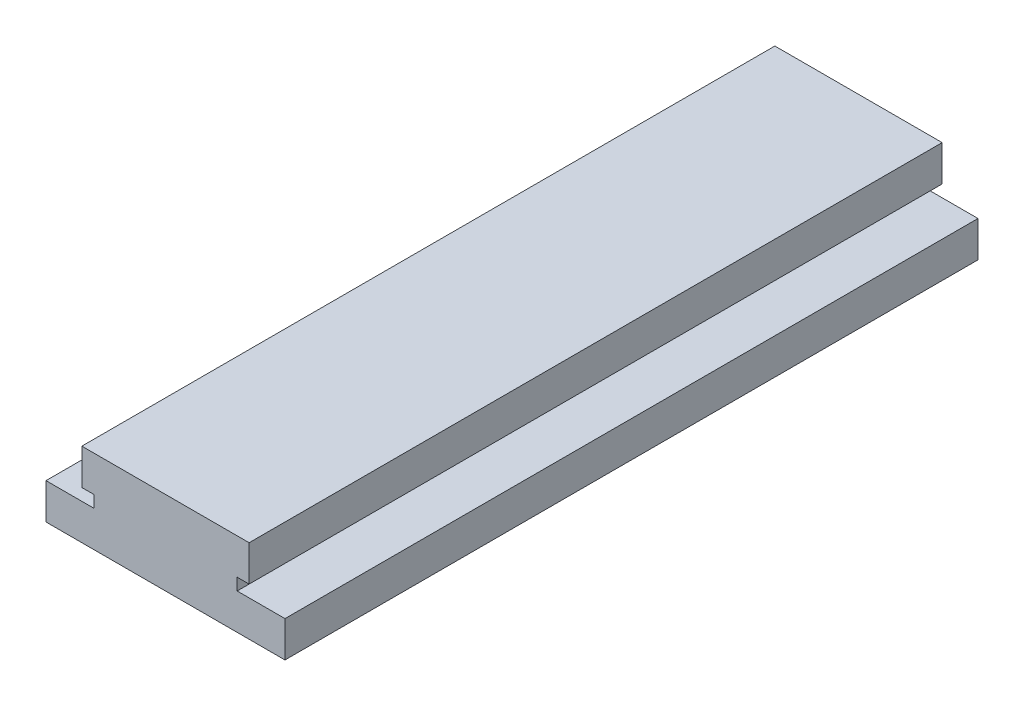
ISO-10303-21;
HEADER;
FILE_DESCRIPTION(('STEP AP214'),'2;1');
FILE_NAME('part.step','',(''),(''),'','','');
FILE_SCHEMA(('AUTOMOTIVE_DESIGN { 1 0 10303 214 1 1 1 1 }'));
ENDSEC;
DATA;
#1=APPLICATION_CONTEXT('core data for automotive mechanical design processes');
#2=APPLICATION_PROTOCOL_DEFINITION('international standard','automotive_design',2000,#1);
#3=PRODUCT_CONTEXT('',#1,'mechanical');
#4=PRODUCT('Part','Part','',(#3));
#5=PRODUCT_RELATED_PRODUCT_CATEGORY('part','',(#4));
#6=PRODUCT_DEFINITION_FORMATION('','',#4);
#7=PRODUCT_DEFINITION_CONTEXT('part definition',#1,'design');
#8=PRODUCT_DEFINITION('design','',#6,#7);
#9=PRODUCT_DEFINITION_SHAPE('','',#8);
#10=(LENGTH_UNIT() NAMED_UNIT(*) SI_UNIT(.MILLI.,.METRE.));
#11=(NAMED_UNIT(*) PLANE_ANGLE_UNIT() SI_UNIT($,.RADIAN.));
#12=(NAMED_UNIT(*) SI_UNIT($,.STERADIAN.) SOLID_ANGLE_UNIT());
#13=UNCERTAINTY_MEASURE_WITH_UNIT(LENGTH_MEASURE(1.E-05),#10,'distance_accuracy_value','');
#14=(GEOMETRIC_REPRESENTATION_CONTEXT(3) GLOBAL_UNCERTAINTY_ASSIGNED_CONTEXT((#13)) GLOBAL_UNIT_ASSIGNED_CONTEXT((#10,
#11,#12)) REPRESENTATION_CONTEXT('',''));
#15=CARTESIAN_POINT('',(0.,0.,0.));
#16=DIRECTION('',(0.,0.,1.));
#17=DIRECTION('',(1.,0.,0.));
#18=AXIS2_PLACEMENT_3D('',#15,#16,#17);
#19=CARTESIAN_POINT('',(-10.,3.,29.));
#20=DIRECTION('',(1.,0.,0.));
#21=DIRECTION('',(0.,0.,-1.));
#22=AXIS2_PLACEMENT_3D('',#19,#20,#21);
#23=PLANE('',#22);
#24=DIRECTION('',(0.,0.,-1.));
#25=VECTOR('',#24,1.);
#26=CARTESIAN_POINT('',(-10.,3.,29.));
#27=LINE('',#26,#25);
#28=CARTESIAN_POINT('',(-10.,3.,29.));
#29=VERTEX_POINT('',#28);
#30=CARTESIAN_POINT('',(-10.,3.,-29.));
#31=VERTEX_POINT('',#30);
#32=EDGE_CURVE('E136',#29,#31,#27,.T.);
#33=ORIENTED_EDGE('',*,*,#32,.T.);
#34=DIRECTION('',(0.,-1.,0.));
#35=VECTOR('',#34,1.);
#36=CARTESIAN_POINT('',(-10.,3.,-29.));
#37=LINE('',#36,#35);
#38=CARTESIAN_POINT('',(-10.,0.,-29.));
#39=VERTEX_POINT('',#38);
#40=EDGE_CURVE('E130',#31,#39,#37,.T.);
#41=ORIENTED_EDGE('',*,*,#40,.T.);
#42=DIRECTION('',(0.,0.,-1.));
#43=VECTOR('',#42,1.);
#44=CARTESIAN_POINT('',(-10.,0.,29.));
#45=LINE('',#44,#43);
#46=CARTESIAN_POINT('',(-10.,0.,29.));
#47=VERTEX_POINT('',#46);
#48=EDGE_CURVE('E11',#47,#39,#45,.T.);
#49=ORIENTED_EDGE('',*,*,#48,.F.);
#50=DIRECTION('',(0.,-1.,0.));
#51=VECTOR('',#50,1.);
#52=CARTESIAN_POINT('',(-10.,3.,29.));
#53=LINE('',#52,#51);
#54=EDGE_CURVE('E166',#29,#47,#53,.T.);
#55=ORIENTED_EDGE('',*,*,#54,.F.);
#56=EDGE_LOOP('',(#33,#41,#49,#55));
#57=FACE_BOUND('',#56,.T.);
#58=ADVANCED_FACE('F30',(#57),#23,.F.);
#59=CARTESIAN_POINT('',(-10.,0.,29.));
#60=DIRECTION('',(0.,1.,0.));
#61=DIRECTION('',(0.,0.,1.));
#62=AXIS2_PLACEMENT_3D('',#59,#60,#61);
#63=PLANE('',#62);
#64=ORIENTED_EDGE('',*,*,#48,.T.);
#65=DIRECTION('',(1.,0.,0.));
#66=VECTOR('',#65,1.);
#67=CARTESIAN_POINT('',(-10.,0.,-29.));
#68=LINE('',#67,#66);
#69=CARTESIAN_POINT('',(10.,0.,-29.));
#70=VERTEX_POINT('',#69);
#71=EDGE_CURVE('E120',#39,#70,#68,.T.);
#72=ORIENTED_EDGE('',*,*,#71,.T.);
#73=DIRECTION('',(0.,0.,-1.));
#74=VECTOR('',#73,1.);
#75=CARTESIAN_POINT('',(10.,0.,29.));
#76=LINE('',#75,#74);
#77=CARTESIAN_POINT('',(10.,0.,29.));
#78=VERTEX_POINT('',#77);
#79=EDGE_CURVE('E37',#78,#70,#76,.T.);
#80=ORIENTED_EDGE('',*,*,#79,.F.);
#81=DIRECTION('',(1.,0.,0.));
#82=VECTOR('',#81,1.);
#83=CARTESIAN_POINT('',(-10.,0.,29.));
#84=LINE('',#83,#82);
#85=EDGE_CURVE('E121',#47,#78,#84,.T.);
#86=ORIENTED_EDGE('',*,*,#85,.F.);
#87=EDGE_LOOP('',(#64,#72,#80,#86));
#88=FACE_BOUND('',#87,.T.);
#89=ADVANCED_FACE('F118',(#88),#63,.F.);
#90=CARTESIAN_POINT('',(10.,0.,29.));
#91=DIRECTION('',(-1.,0.,0.));
#92=DIRECTION('',(0.,0.,1.));
#93=AXIS2_PLACEMENT_3D('',#90,#91,#92);
#94=PLANE('',#93);
#95=ORIENTED_EDGE('',*,*,#79,.T.);
#96=DIRECTION('',(0.,1.,0.));
#97=VECTOR('',#96,1.);
#98=CARTESIAN_POINT('',(10.,0.,-29.));
#99=LINE('',#98,#97);
#100=CARTESIAN_POINT('',(10.,3.,-29.));
#101=VERTEX_POINT('',#100);
#102=EDGE_CURVE('E134',#70,#101,#99,.T.);
#103=ORIENTED_EDGE('',*,*,#102,.T.);
#104=DIRECTION('',(0.,0.,-1.));
#105=VECTOR('',#104,1.);
#106=CARTESIAN_POINT('',(10.,3.,29.));
#107=LINE('',#106,#105);
#108=CARTESIAN_POINT('',(10.,3.,29.));
#109=VERTEX_POINT('',#108);
#110=EDGE_CURVE('E204',#109,#101,#107,.T.);
#111=ORIENTED_EDGE('',*,*,#110,.F.);
#112=DIRECTION('',(0.,1.,0.));
#113=VECTOR('',#112,1.);
#114=CARTESIAN_POINT('',(10.,0.,29.));
#115=LINE('',#114,#113);
#116=EDGE_CURVE('E169',#78,#109,#115,.T.);
#117=ORIENTED_EDGE('',*,*,#116,.F.);
#118=EDGE_LOOP('',(#95,#103,#111,#117));
#119=FACE_BOUND('',#118,.T.);
#120=ADVANCED_FACE('F207',(#119),#94,.F.);
#121=CARTESIAN_POINT('',(10.,3.,29.));
#122=DIRECTION('',(0.,-1.,0.));
#123=DIRECTION('',(1.,0.,0.));
#124=AXIS2_PLACEMENT_3D('',#121,#122,#123);
#125=PLANE('',#124);
#126=ORIENTED_EDGE('',*,*,#110,.T.);
#127=DIRECTION('',(-1.,0.,0.));
#128=VECTOR('',#127,1.);
#129=CARTESIAN_POINT('',(10.,3.,-29.));
#130=LINE('',#129,#128);
#131=CARTESIAN_POINT('',(6.,3.,-29.));
#132=VERTEX_POINT('',#131);
#133=EDGE_CURVE('E140',#101,#132,#130,.T.);
#134=ORIENTED_EDGE('',*,*,#133,.T.);
#135=DIRECTION('',(0.,0.,-1.));
#136=VECTOR('',#135,1.);
#137=CARTESIAN_POINT('',(6.,3.,29.));
#138=LINE('',#137,#136);
#139=CARTESIAN_POINT('',(6.,3.,29.));
#140=VERTEX_POINT('',#139);
#141=EDGE_CURVE('E202',#140,#132,#138,.T.);
#142=ORIENTED_EDGE('',*,*,#141,.F.);
#143=DIRECTION('',(-1.,0.,0.));
#144=VECTOR('',#143,1.);
#145=CARTESIAN_POINT('',(10.,3.,29.));
#146=LINE('',#145,#144);
#147=EDGE_CURVE('E171',#109,#140,#146,.T.);
#148=ORIENTED_EDGE('',*,*,#147,.F.);
#149=EDGE_LOOP('',(#126,#134,#142,#148));
#150=FACE_BOUND('',#149,.T.);
#151=ADVANCED_FACE('F215',(#150),#125,.F.);
#152=CARTESIAN_POINT('',(6.,4.,29.));
#153=DIRECTION('',(-1.,0.,0.));
#154=DIRECTION('',(0.,0.,1.));
#155=AXIS2_PLACEMENT_3D('',#152,#153,#154);
#156=PLANE('',#155);
#157=ORIENTED_EDGE('',*,*,#141,.T.);
#158=DIRECTION('',(0.,1.,0.));
#159=VECTOR('',#158,1.);
#160=CARTESIAN_POINT('',(6.,4.,-29.));
#161=LINE('',#160,#159);
#162=CARTESIAN_POINT('',(6.,4.,-29.));
#163=VERTEX_POINT('',#162);
#164=EDGE_CURVE('E143',#132,#163,#161,.T.);
#165=ORIENTED_EDGE('',*,*,#164,.T.);
#166=DIRECTION('',(0.,0.,-1.));
#167=VECTOR('',#166,1.);
#168=CARTESIAN_POINT('',(6.,4.,29.));
#169=LINE('',#168,#167);
#170=CARTESIAN_POINT('',(6.,4.,29.));
#171=VERTEX_POINT('',#170);
#172=EDGE_CURVE('E200',#171,#163,#169,.T.);
#173=ORIENTED_EDGE('',*,*,#172,.F.);
#174=DIRECTION('',(0.,1.,0.));
#175=VECTOR('',#174,1.);
#176=CARTESIAN_POINT('',(6.,4.,29.));
#177=LINE('',#176,#175);
#178=EDGE_CURVE('E173',#140,#171,#177,.T.);
#179=ORIENTED_EDGE('',*,*,#178,.F.);
#180=EDGE_LOOP('',(#157,#165,#173,#179));
#181=FACE_BOUND('',#180,.T.);
#182=ADVANCED_FACE('F218',(#181),#156,.F.);
#183=CARTESIAN_POINT('',(7.,4.,29.));
#184=DIRECTION('',(0.,1.,0.));
#185=DIRECTION('',(0.,0.,1.));
#186=AXIS2_PLACEMENT_3D('',#183,#184,#185);
#187=PLANE('',#186);
#188=ORIENTED_EDGE('',*,*,#172,.T.);
#189=DIRECTION('',(1.,0.,0.));
#190=VECTOR('',#189,1.);
#191=CARTESIAN_POINT('',(7.,4.,-29.));
#192=LINE('',#191,#190);
#193=CARTESIAN_POINT('',(7.,4.,-29.));
#194=VERTEX_POINT('',#193);
#195=EDGE_CURVE('E146',#163,#194,#192,.T.);
#196=ORIENTED_EDGE('',*,*,#195,.T.);
#197=DIRECTION('',(0.,0.,-1.));
#198=VECTOR('',#197,1.);
#199=CARTESIAN_POINT('',(7.,4.,29.));
#200=LINE('',#199,#198);
#201=CARTESIAN_POINT('',(7.,4.,29.));
#202=VERTEX_POINT('',#201);
#203=EDGE_CURVE('E198',#202,#194,#200,.T.);
#204=ORIENTED_EDGE('',*,*,#203,.F.);
#205=DIRECTION('',(1.,0.,0.));
#206=VECTOR('',#205,1.);
#207=CARTESIAN_POINT('',(7.,4.,29.));
#208=LINE('',#207,#206);
#209=EDGE_CURVE('E175',#171,#202,#208,.T.);
#210=ORIENTED_EDGE('',*,*,#209,.F.);
#211=EDGE_LOOP('',(#188,#196,#204,#210));
#212=FACE_BOUND('',#211,.T.);
#213=ADVANCED_FACE('F223',(#212),#187,.F.);
#214=CARTESIAN_POINT('',(7.,7.,29.));
#215=DIRECTION('',(-1.,0.,0.));
#216=DIRECTION('',(0.,0.,1.));
#217=AXIS2_PLACEMENT_3D('',#214,#215,#216);
#218=PLANE('',#217);
#219=ORIENTED_EDGE('',*,*,#203,.T.);
#220=DIRECTION('',(0.,1.,0.));
#221=VECTOR('',#220,1.);
#222=CARTESIAN_POINT('',(7.,7.,-29.));
#223=LINE('',#222,#221);
#224=CARTESIAN_POINT('',(7.,7.,-29.));
#225=VERTEX_POINT('',#224);
#226=EDGE_CURVE('E149',#194,#225,#223,.T.);
#227=ORIENTED_EDGE('',*,*,#226,.T.);
#228=DIRECTION('',(0.,0.,-1.));
#229=VECTOR('',#228,1.);
#230=CARTESIAN_POINT('',(7.,7.,29.));
#231=LINE('',#230,#229);
#232=CARTESIAN_POINT('',(7.,7.,29.));
#233=VERTEX_POINT('',#232);
#234=EDGE_CURVE('E196',#233,#225,#231,.T.);
#235=ORIENTED_EDGE('',*,*,#234,.F.);
#236=DIRECTION('',(0.,1.,0.));
#237=VECTOR('',#236,1.);
#238=CARTESIAN_POINT('',(7.,7.,29.));
#239=LINE('',#238,#237);
#240=EDGE_CURVE('E177',#202,#233,#239,.T.);
#241=ORIENTED_EDGE('',*,*,#240,.F.);
#242=EDGE_LOOP('',(#219,#227,#235,#241));
#243=FACE_BOUND('',#242,.T.);
#244=ADVANCED_FACE('F229',(#243),#218,.F.);
#245=CARTESIAN_POINT('',(-7.,7.,29.));
#246=DIRECTION('',(0.,-1.,0.));
#247=DIRECTION('',(0.,0.,-1.));
#248=AXIS2_PLACEMENT_3D('',#245,#246,#247);
#249=PLANE('',#248);
#250=ORIENTED_EDGE('',*,*,#234,.T.);
#251=DIRECTION('',(-1.,0.,0.));
#252=VECTOR('',#251,1.);
#253=CARTESIAN_POINT('',(-7.,7.,-29.));
#254=LINE('',#253,#252);
#255=CARTESIAN_POINT('',(-7.,7.,-29.));
#256=VERTEX_POINT('',#255);
#257=EDGE_CURVE('E152',#225,#256,#254,.T.);
#258=ORIENTED_EDGE('',*,*,#257,.T.);
#259=DIRECTION('',(0.,0.,-1.));
#260=VECTOR('',#259,1.);
#261=CARTESIAN_POINT('',(-7.,7.,29.));
#262=LINE('',#261,#260);
#263=CARTESIAN_POINT('',(-7.,7.,29.));
#264=VERTEX_POINT('',#263);
#265=EDGE_CURVE('E194',#264,#256,#262,.T.);
#266=ORIENTED_EDGE('',*,*,#265,.F.);
#267=DIRECTION('',(-1.,0.,0.));
#268=VECTOR('',#267,1.);
#269=CARTESIAN_POINT('',(-7.,7.,29.));
#270=LINE('',#269,#268);
#271=EDGE_CURVE('E179',#233,#264,#270,.T.);
#272=ORIENTED_EDGE('',*,*,#271,.F.);
#273=EDGE_LOOP('',(#250,#258,#266,#272));
#274=FACE_BOUND('',#273,.T.);
#275=ADVANCED_FACE('F233',(#274),#249,.F.);
#276=CARTESIAN_POINT('',(-7.,4.,29.));
#277=DIRECTION('',(1.,0.,0.));
#278=DIRECTION('',(0.,0.,-1.));
#279=AXIS2_PLACEMENT_3D('',#276,#277,#278);
#280=PLANE('',#279);
#281=ORIENTED_EDGE('',*,*,#265,.T.);
#282=DIRECTION('',(0.,-1.,0.));
#283=VECTOR('',#282,1.);
#284=CARTESIAN_POINT('',(-7.,4.,-29.));
#285=LINE('',#284,#283);
#286=CARTESIAN_POINT('',(-7.,4.,-29.));
#287=VERTEX_POINT('',#286);
#288=EDGE_CURVE('E155',#256,#287,#285,.T.);
#289=ORIENTED_EDGE('',*,*,#288,.T.);
#290=DIRECTION('',(0.,0.,-1.));
#291=VECTOR('',#290,1.);
#292=CARTESIAN_POINT('',(-7.,4.,29.));
#293=LINE('',#292,#291);
#294=CARTESIAN_POINT('',(-7.,4.,29.));
#295=VERTEX_POINT('',#294);
#296=EDGE_CURVE('E192',#295,#287,#293,.T.);
#297=ORIENTED_EDGE('',*,*,#296,.F.);
#298=DIRECTION('',(0.,-1.,0.));
#299=VECTOR('',#298,1.);
#300=CARTESIAN_POINT('',(-7.,4.,29.));
#301=LINE('',#300,#299);
#302=EDGE_CURVE('E181',#264,#295,#301,.T.);
#303=ORIENTED_EDGE('',*,*,#302,.F.);
#304=EDGE_LOOP('',(#281,#289,#297,#303));
#305=FACE_BOUND('',#304,.T.);
#306=ADVANCED_FACE('F238',(#305),#280,.F.);
#307=CARTESIAN_POINT('',(-6.,4.,29.));
#308=DIRECTION('',(0.,1.,0.));
#309=DIRECTION('',(0.,0.,1.));
#310=AXIS2_PLACEMENT_3D('',#307,#308,#309);
#311=PLANE('',#310);
#312=ORIENTED_EDGE('',*,*,#296,.T.);
#313=DIRECTION('',(1.,0.,0.));
#314=VECTOR('',#313,1.);
#315=CARTESIAN_POINT('',(-6.,4.,-29.));
#316=LINE('',#315,#314);
#317=CARTESIAN_POINT('',(-6.,4.,-29.));
#318=VERTEX_POINT('',#317);
#319=EDGE_CURVE('E158',#287,#318,#316,.T.);
#320=ORIENTED_EDGE('',*,*,#319,.T.);
#321=DIRECTION('',(0.,0.,-1.));
#322=VECTOR('',#321,1.);
#323=CARTESIAN_POINT('',(-6.,4.,29.));
#324=LINE('',#323,#322);
#325=CARTESIAN_POINT('',(-6.,4.,29.));
#326=VERTEX_POINT('',#325);
#327=EDGE_CURVE('E190',#326,#318,#324,.T.);
#328=ORIENTED_EDGE('',*,*,#327,.F.);
#329=DIRECTION('',(1.,0.,0.));
#330=VECTOR('',#329,1.);
#331=CARTESIAN_POINT('',(-6.,4.,29.));
#332=LINE('',#331,#330);
#333=EDGE_CURVE('E183',#295,#326,#332,.T.);
#334=ORIENTED_EDGE('',*,*,#333,.F.);
#335=EDGE_LOOP('',(#312,#320,#328,#334));
#336=FACE_BOUND('',#335,.T.);
#337=ADVANCED_FACE('F242',(#336),#311,.F.);
#338=CARTESIAN_POINT('',(-6.,3.,29.));
#339=DIRECTION('',(1.,0.,0.));
#340=DIRECTION('',(0.,1.,0.));
#341=AXIS2_PLACEMENT_3D('',#338,#339,#340);
#342=PLANE('',#341);
#343=ORIENTED_EDGE('',*,*,#327,.T.);
#344=DIRECTION('',(0.,-1.,0.));
#345=VECTOR('',#344,1.);
#346=CARTESIAN_POINT('',(-6.,3.,-29.));
#347=LINE('',#346,#345);
#348=CARTESIAN_POINT('',(-6.,3.,-29.));
#349=VERTEX_POINT('',#348);
#350=EDGE_CURVE('E161',#318,#349,#347,.T.);
#351=ORIENTED_EDGE('',*,*,#350,.T.);
#352=DIRECTION('',(0.,0.,-1.));
#353=VECTOR('',#352,1.);
#354=CARTESIAN_POINT('',(-6.,3.,29.));
#355=LINE('',#354,#353);
#356=CARTESIAN_POINT('',(-6.,3.,29.));
#357=VERTEX_POINT('',#356);
#358=EDGE_CURVE('E188',#357,#349,#355,.T.);
#359=ORIENTED_EDGE('',*,*,#358,.F.);
#360=DIRECTION('',(0.,-1.,0.));
#361=VECTOR('',#360,1.);
#362=CARTESIAN_POINT('',(-6.,3.,29.));
#363=LINE('',#362,#361);
#364=EDGE_CURVE('E49',#326,#357,#363,.T.);
#365=ORIENTED_EDGE('',*,*,#364,.F.);
#366=EDGE_LOOP('',(#343,#351,#359,#365));
#367=FACE_BOUND('',#366,.T.);
#368=ADVANCED_FACE('F246',(#367),#342,.F.);
#369=CARTESIAN_POINT('',(-6.,3.,29.));
#370=DIRECTION('',(0.,-1.,0.));
#371=DIRECTION('',(1.,0.,0.));
#372=AXIS2_PLACEMENT_3D('',#369,#370,#371);
#373=PLANE('',#372);
#374=ORIENTED_EDGE('',*,*,#358,.T.);
#375=DIRECTION('',(-1.,0.,0.));
#376=VECTOR('',#375,1.);
#377=CARTESIAN_POINT('',(-6.,3.,-29.));
#378=LINE('',#377,#376);
#379=EDGE_CURVE('E164',#349,#31,#378,.T.);
#380=ORIENTED_EDGE('',*,*,#379,.T.);
#381=ORIENTED_EDGE('',*,*,#32,.F.);
#382=DIRECTION('',(-1.,0.,0.));
#383=VECTOR('',#382,1.);
#384=CARTESIAN_POINT('',(-6.,3.,29.));
#385=LINE('',#384,#383);
#386=EDGE_CURVE('E44',#357,#29,#385,.T.);
#387=ORIENTED_EDGE('',*,*,#386,.F.);
#388=EDGE_LOOP('',(#374,#380,#381,#387));
#389=FACE_BOUND('',#388,.T.);
#390=ADVANCED_FACE('F248',(#389),#373,.F.);
#391=CARTESIAN_POINT('',(-10.,0.,29.));
#392=DIRECTION('',(0.,0.,1.));
#393=DIRECTION('',(1.,0.,0.));
#394=AXIS2_PLACEMENT_3D('',#391,#392,#393);
#395=PLANE('',#394);
#396=ORIENTED_EDGE('',*,*,#54,.T.);
#397=ORIENTED_EDGE('',*,*,#85,.T.);
#398=ORIENTED_EDGE('',*,*,#116,.T.);
#399=ORIENTED_EDGE('',*,*,#147,.T.);
#400=ORIENTED_EDGE('',*,*,#178,.T.);
#401=ORIENTED_EDGE('',*,*,#209,.T.);
#402=ORIENTED_EDGE('',*,*,#240,.T.);
#403=ORIENTED_EDGE('',*,*,#271,.T.);
#404=ORIENTED_EDGE('',*,*,#302,.T.);
#405=ORIENTED_EDGE('',*,*,#333,.T.);
#406=ORIENTED_EDGE('',*,*,#364,.T.);
#407=ORIENTED_EDGE('',*,*,#386,.T.);
#408=EDGE_LOOP('',(#396,#397,#398,#399,#400,#401,#402,#403,#404,#405,#406,#407));
#409=FACE_BOUND('',#408,.T.);
#410=ADVANCED_FACE('F210',(#409),#395,.T.);
#411=CARTESIAN_POINT('',(-10.,0.,-29.));
#412=DIRECTION('',(0.,0.,1.));
#413=DIRECTION('',(1.,0.,0.));
#414=AXIS2_PLACEMENT_3D('',#411,#412,#413);
#415=PLANE('',#414);
#416=ORIENTED_EDGE('',*,*,#40,.F.);
#417=ORIENTED_EDGE('',*,*,#379,.F.);
#418=ORIENTED_EDGE('',*,*,#350,.F.);
#419=ORIENTED_EDGE('',*,*,#319,.F.);
#420=ORIENTED_EDGE('',*,*,#288,.F.);
#421=ORIENTED_EDGE('',*,*,#257,.F.);
#422=ORIENTED_EDGE('',*,*,#226,.F.);
#423=ORIENTED_EDGE('',*,*,#195,.F.);
#424=ORIENTED_EDGE('',*,*,#164,.F.);
#425=ORIENTED_EDGE('',*,*,#133,.F.);
#426=ORIENTED_EDGE('',*,*,#102,.F.);
#427=ORIENTED_EDGE('',*,*,#71,.F.);
#428=EDGE_LOOP('',(#416,#417,#418,#419,#420,#421,#422,#423,#424,#425,#426,#427));
#429=FACE_BOUND('',#428,.T.);
#430=ADVANCED_FACE('F128',(#429),#415,.F.);
#431=CLOSED_SHELL('',(#58,#89,#120,#151,#182,#213,#244,#275,#306,#337,#368,#390,#410,#430));
#432=MANIFOLD_SOLID_BREP('B2',#431);
#433=ADVANCED_BREP_SHAPE_REPRESENTATION('',(#18,#432),#14);
#434=SHAPE_DEFINITION_REPRESENTATION(#9,#433);
ENDSEC;
END-ISO-10303-21;
